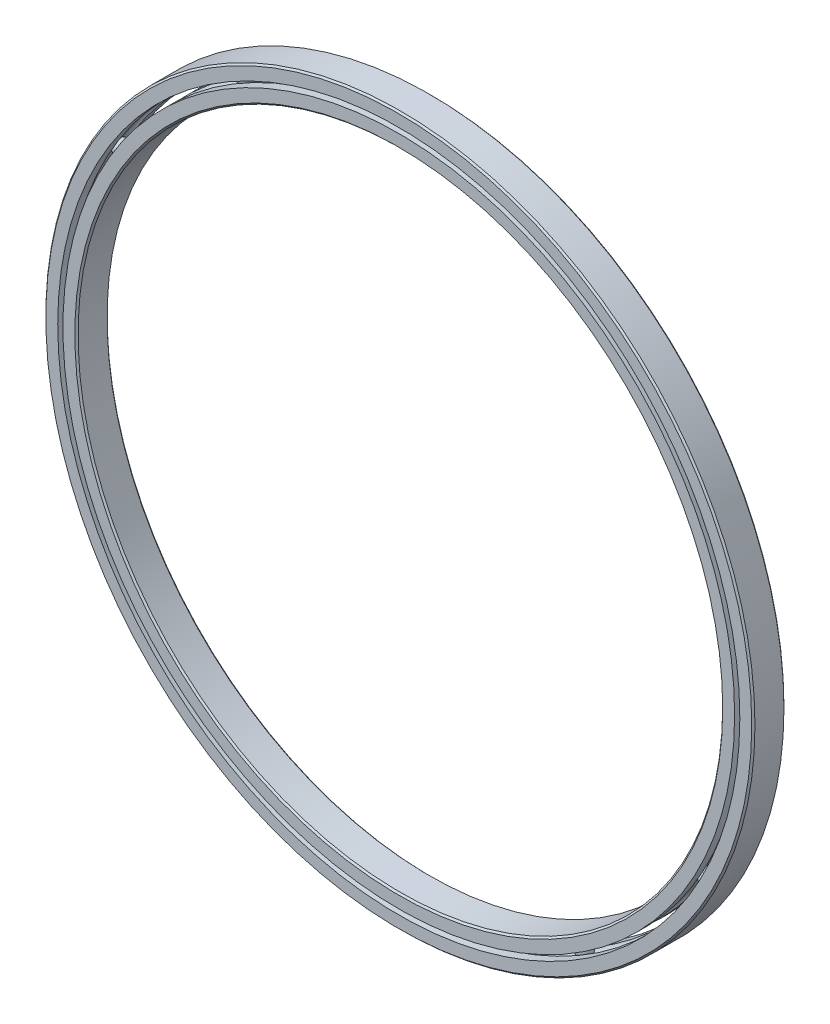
ISO-10303-21;
HEADER;
FILE_DESCRIPTION(('STEP AP214'),'2;1');
FILE_NAME('part.step','',(''),(''),'','','');
FILE_SCHEMA(('AUTOMOTIVE_DESIGN { 1 0 10303 214 1 1 1 1 }'));
ENDSEC;
DATA;
#1=APPLICATION_CONTEXT('core data for automotive mechanical design processes');
#2=APPLICATION_PROTOCOL_DEFINITION('international standard','automotive_design',2000,#1);
#3=PRODUCT_CONTEXT('',#1,'mechanical');
#4=PRODUCT('Part','Part','',(#3));
#5=PRODUCT_RELATED_PRODUCT_CATEGORY('part','',(#4));
#6=PRODUCT_DEFINITION_FORMATION('','',#4);
#7=PRODUCT_DEFINITION_CONTEXT('part definition',#1,'design');
#8=PRODUCT_DEFINITION('design','',#6,#7);
#9=PRODUCT_DEFINITION_SHAPE('','',#8);
#10=(LENGTH_UNIT() NAMED_UNIT(*) SI_UNIT(.MILLI.,.METRE.));
#11=(NAMED_UNIT(*) PLANE_ANGLE_UNIT() SI_UNIT($,.RADIAN.));
#12=(NAMED_UNIT(*) SI_UNIT($,.STERADIAN.) SOLID_ANGLE_UNIT());
#13=UNCERTAINTY_MEASURE_WITH_UNIT(LENGTH_MEASURE(1.E-05),#10,'distance_accuracy_value','');
#14=(GEOMETRIC_REPRESENTATION_CONTEXT(3) GLOBAL_UNCERTAINTY_ASSIGNED_CONTEXT((#13)) GLOBAL_UNIT_ASSIGNED_CONTEXT((#10,
#11,#12)) REPRESENTATION_CONTEXT('',''));
#15=CARTESIAN_POINT('',(0.,0.,0.));
#16=DIRECTION('',(0.,0.,1.));
#17=DIRECTION('',(1.,0.,0.));
#18=AXIS2_PLACEMENT_3D('',#15,#16,#17);
#19=CARTESIAN_POINT('',(-33.3374999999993,57.7422437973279,0.));
#20=DIRECTION('',(0.,0.,1.));
#21=DIRECTION('',(-0.499999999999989,0.866025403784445,0.));
#22=AXIS2_PLACEMENT_3D('',#19,#20,#21);
#23=SPHERICAL_SURFACE('',#22,1.50142771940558);
#24=CARTESIAN_POINT('',(-33.3374999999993,57.7422437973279,1.50142771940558));
#25=VERTEX_POINT('',#24);
#26=VERTEX_LOOP('',#25);
#27=FACE_BOUND('',#26,.T.);
#28=ADVANCED_FACE('F41',(#27),#23,.T.);
#29=CLOSED_SHELL('',(#28));
#30=MANIFOLD_SOLID_BREP('B2',#29);
#31=CARTESIAN_POINT('',(-57.7422437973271,33.3375000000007,0.));
#32=DIRECTION('',(0.,0.,1.));
#33=DIRECTION('',(-0.866025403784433,0.50000000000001,0.));
#34=AXIS2_PLACEMENT_3D('',#31,#32,#33);
#35=SPHERICAL_SURFACE('',#34,1.50142771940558);
#36=CARTESIAN_POINT('',(-57.7422437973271,33.3375000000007,1.50142771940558));
#37=VERTEX_POINT('',#36);
#38=VERTEX_LOOP('',#37);
#39=FACE_BOUND('',#38,.T.);
#40=ADVANCED_FACE('F61',(#39),#35,.T.);
#41=CLOSED_SHELL('',(#40));
#42=MANIFOLD_SOLID_BREP('B6',#41);
#43=CARTESIAN_POINT('',(-66.675,6.98383554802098E-13,0.));
#44=DIRECTION('',(0.,0.,1.));
#45=DIRECTION('',(-1.,0.,0.));
#46=AXIS2_PLACEMENT_3D('',#43,#44,#45);
#47=SPHERICAL_SURFACE('',#46,1.50142771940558);
#48=CARTESIAN_POINT('',(-66.675,6.98383554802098E-13,1.50142771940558));
#49=VERTEX_POINT('',#48);
#50=VERTEX_LOOP('',#49);
#51=FACE_BOUND('',#50,.T.);
#52=ADVANCED_FACE('F81',(#51),#47,.T.);
#53=CLOSED_SHELL('',(#52));
#54=MANIFOLD_SOLID_BREP('B37',#53);
#55=CARTESIAN_POINT('',(-57.7422437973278,-33.3374999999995,0.));
#56=DIRECTION('',(0.,0.,1.));
#57=DIRECTION('',(-0.866025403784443,-0.499999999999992,0.));
#58=AXIS2_PLACEMENT_3D('',#55,#56,#57);
#59=SPHERICAL_SURFACE('',#58,1.50142771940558);
#60=CARTESIAN_POINT('',(-57.7422437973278,-33.3374999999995,1.50142771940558));
#61=VERTEX_POINT('',#60);
#62=VERTEX_LOOP('',#61);
#63=FACE_BOUND('',#62,.T.);
#64=ADVANCED_FACE('F101',(#63),#59,.T.);
#65=CLOSED_SHELL('',(#64));
#66=MANIFOLD_SOLID_BREP('B57',#65);
#67=CARTESIAN_POINT('',(-33.3375000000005,-57.7422437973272,0.));
#68=DIRECTION('',(0.,0.,1.));
#69=DIRECTION('',(-0.500000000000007,-0.866025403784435,0.));
#70=AXIS2_PLACEMENT_3D('',#67,#68,#69);
#71=SPHERICAL_SURFACE('',#70,1.50142771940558);
#72=CARTESIAN_POINT('',(-33.3375000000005,-57.7422437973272,1.50142771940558));
#73=VERTEX_POINT('',#72);
#74=VERTEX_LOOP('',#73);
#75=FACE_BOUND('',#74,.T.);
#76=ADVANCED_FACE('F121',(#75),#71,.T.);
#77=CLOSED_SHELL('',(#76));
#78=MANIFOLD_SOLID_BREP('B77',#77);
#79=CARTESIAN_POINT('',(-4.65589036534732E-13,-66.675,0.));
#80=DIRECTION('',(0.,0.,1.));
#81=DIRECTION('',(0.,-1.,0.));
#82=AXIS2_PLACEMENT_3D('',#79,#80,#81);
#83=SPHERICAL_SURFACE('',#82,1.50142771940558);
#84=CARTESIAN_POINT('',(-4.65589036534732E-13,-66.675,1.50142771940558));
#85=VERTEX_POINT('',#84);
#86=VERTEX_LOOP('',#85);
#87=FACE_BOUND('',#86,.T.);
#88=ADVANCED_FACE('F141',(#87),#83,.T.);
#89=CLOSED_SHELL('',(#88));
#90=MANIFOLD_SOLID_BREP('B97',#89);
#91=CARTESIAN_POINT('',(33.3374999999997,-57.7422437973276,0.));
#92=DIRECTION('',(0.,0.,1.));
#93=DIRECTION('',(0.499999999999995,-0.866025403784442,0.));
#94=AXIS2_PLACEMENT_3D('',#91,#92,#93);
#95=SPHERICAL_SURFACE('',#94,1.50142771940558);
#96=CARTESIAN_POINT('',(33.3374999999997,-57.7422437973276,1.50142771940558));
#97=VERTEX_POINT('',#96);
#98=VERTEX_LOOP('',#97);
#99=FACE_BOUND('',#98,.T.);
#100=ADVANCED_FACE('F161',(#99),#95,.T.);
#101=CLOSED_SHELL('',(#100));
#102=MANIFOLD_SOLID_BREP('B117',#101);
#103=CARTESIAN_POINT('',(57.7422437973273,-33.3375000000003,0.));
#104=DIRECTION('',(0.,0.,1.));
#105=DIRECTION('',(0.866025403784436,-0.500000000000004,0.));
#106=AXIS2_PLACEMENT_3D('',#103,#104,#105);
#107=SPHERICAL_SURFACE('',#106,1.50142771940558);
#108=CARTESIAN_POINT('',(57.7422437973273,-33.3375000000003,1.50142771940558));
#109=VERTEX_POINT('',#108);
#110=VERTEX_LOOP('',#109);
#111=FACE_BOUND('',#110,.T.);
#112=ADVANCED_FACE('F181',(#111),#107,.T.);
#113=CLOSED_SHELL('',(#112));
#114=MANIFOLD_SOLID_BREP('B137',#113);
#115=CARTESIAN_POINT('',(66.675,-2.32794518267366E-13,0.));
#116=DIRECTION('',(0.,0.,1.));
#117=DIRECTION('',(1.,0.,0.));
#118=AXIS2_PLACEMENT_3D('',#115,#116,#117);
#119=SPHERICAL_SURFACE('',#118,1.50142771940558);
#120=CARTESIAN_POINT('',(66.675,-2.32794518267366E-13,1.50142771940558));
#121=VERTEX_POINT('',#120);
#122=VERTEX_LOOP('',#121);
#123=FACE_BOUND('',#122,.T.);
#124=ADVANCED_FACE('F201',(#123),#119,.T.);
#125=CLOSED_SHELL('',(#124));
#126=MANIFOLD_SOLID_BREP('B157',#125);
#127=CARTESIAN_POINT('',(57.7422437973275,33.3374999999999,0.));
#128=DIRECTION('',(0.,0.,1.));
#129=DIRECTION('',(0.86602540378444,0.499999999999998,0.));
#130=AXIS2_PLACEMENT_3D('',#127,#128,#129);
#131=SPHERICAL_SURFACE('',#130,1.50142771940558);
#132=CARTESIAN_POINT('',(57.7422437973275,33.3374999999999,1.50142771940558));
#133=VERTEX_POINT('',#132);
#134=VERTEX_LOOP('',#133);
#135=FACE_BOUND('',#134,.T.);
#136=ADVANCED_FACE('F221',(#135),#131,.T.);
#137=CLOSED_SHELL('',(#136));
#138=MANIFOLD_SOLID_BREP('B177',#137);
#139=CARTESIAN_POINT('',(33.3375000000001,57.7422437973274,0.));
#140=DIRECTION('',(0.,0.,1.));
#141=DIRECTION('',(0.500000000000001,0.866025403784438,0.));
#142=AXIS2_PLACEMENT_3D('',#139,#140,#141);
#143=SPHERICAL_SURFACE('',#142,1.50142771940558);
#144=CARTESIAN_POINT('',(33.3375000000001,57.7422437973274,1.50142771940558));
#145=VERTEX_POINT('',#144);
#146=VERTEX_LOOP('',#145);
#147=FACE_BOUND('',#146,.T.);
#148=ADVANCED_FACE('F241',(#147),#143,.T.);
#149=CLOSED_SHELL('',(#148));
#150=MANIFOLD_SOLID_BREP('B197',#149);
#151=CARTESIAN_POINT('',(0.,66.675,0.));
#152=DIRECTION('',(0.,0.,1.));
#153=DIRECTION('',(0.,1.,0.));
#154=AXIS2_PLACEMENT_3D('',#151,#152,#153);
#155=SPHERICAL_SURFACE('',#154,1.50142771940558);
#156=CARTESIAN_POINT('',(0.,66.675,1.50142771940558));
#157=VERTEX_POINT('',#156);
#158=VERTEX_LOOP('',#157);
#159=FACE_BOUND('',#158,.T.);
#160=ADVANCED_FACE('F263',(#159),#155,.T.);
#161=CLOSED_SHELL('',(#160));
#162=MANIFOLD_SOLID_BREP('B217',#161);
#163=CARTESIAN_POINT('',(0.,66.1621153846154,3.17500000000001));
#164=DIRECTION('',(0.,0.,-1.));
#165=DIRECTION('',(-1.,0.,0.));
#166=AXIS2_PLACEMENT_3D('',#163,#164,#165);
#167=PLANE('',#166);
#168=CARTESIAN_POINT('',(0.,0.,3.17500000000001));
#169=DIRECTION('',(0.,0.,1.));
#170=DIRECTION('',(1.,0.,0.));
#171=AXIS2_PLACEMENT_3D('',#168,#169,#170);
#172=CIRCLE('',#171,63.8175);
#173=CARTESIAN_POINT('',(63.8175,0.,3.17500000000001));
#174=VERTEX_POINT('',#173);
#175=EDGE_CURVE('E310',#174,#174,#172,.T.);
#176=ORIENTED_EDGE('',*,*,#175,.F.);
#177=EDGE_LOOP('',(#176));
#178=FACE_BOUND('',#177,.T.);
#179=CARTESIAN_POINT('',(0.,0.,3.17500000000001));
#180=DIRECTION('',(0.,0.,1.));
#181=DIRECTION('',(1.,0.,0.));
#182=AXIS2_PLACEMENT_3D('',#179,#180,#181);
#183=CIRCLE('',#182,66.1621153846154);
#184=CARTESIAN_POINT('',(66.1621153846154,0.,3.17500000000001));
#185=VERTEX_POINT('',#184);
#186=EDGE_CURVE('E262',#185,#185,#183,.T.);
#187=ORIENTED_EDGE('',*,*,#186,.T.);
#188=EDGE_LOOP('',(#187));
#189=FACE_BOUND('',#188,.T.);
#190=ADVANCED_FACE('F282',(#178,#189),#167,.F.);
#191=CARTESIAN_POINT('',(0.,0.,3.175));
#192=DIRECTION('',(0.,0.,1.));
#193=DIRECTION('',(1.,0.,0.));
#194=AXIS2_PLACEMENT_3D('',#191,#192,#193);
#195=CYLINDRICAL_SURFACE('',#194,66.1621153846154);
#196=ORIENTED_EDGE('',*,*,#186,.F.);
#197=EDGE_LOOP('',(#196));
#198=FACE_BOUND('',#197,.T.);
#199=CARTESIAN_POINT('',(0.,0.,1.41111111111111));
#200=DIRECTION('',(0.,0.,1.));
#201=DIRECTION('',(1.,0.,0.));
#202=AXIS2_PLACEMENT_3D('',#199,#200,#201);
#203=CIRCLE('',#202,66.1621153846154);
#204=CARTESIAN_POINT('',(66.1621153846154,0.,1.41111111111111));
#205=VERTEX_POINT('',#204);
#206=EDGE_CURVE('E288',#205,#205,#203,.T.);
#207=ORIENTED_EDGE('',*,*,#206,.T.);
#208=EDGE_LOOP('',(#207));
#209=FACE_BOUND('',#208,.T.);
#210=ADVANCED_FACE('F317',(#198,#209),#195,.T.);
#211=CARTESIAN_POINT('',(0.,0.,0.));
#212=DIRECTION('',(0.,0.,1.));
#213=DIRECTION('',(1.,0.,0.));
#214=AXIS2_PLACEMENT_3D('',#211,#212,#213);
#215=TOROIDAL_SURFACE('',#214,66.675,1.50142771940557);
#216=ORIENTED_EDGE('',*,*,#206,.F.);
#217=EDGE_LOOP('',(#216));
#218=FACE_BOUND('',#217,.T.);
#219=CARTESIAN_POINT('',(0.,0.,-1.41111111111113));
#220=DIRECTION('',(0.,0.,1.));
#221=DIRECTION('',(1.,0.,0.));
#222=AXIS2_PLACEMENT_3D('',#219,#220,#221);
#223=CIRCLE('',#222,66.1621153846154);
#224=CARTESIAN_POINT('',(66.1621153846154,0.,-1.41111111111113));
#225=VERTEX_POINT('',#224);
#226=EDGE_CURVE('E292',#225,#225,#223,.T.);
#227=ORIENTED_EDGE('',*,*,#226,.T.);
#228=EDGE_LOOP('',(#227));
#229=FACE_BOUND('',#228,.T.);
#230=ADVANCED_FACE('F321',(#218,#229),#215,.F.);
#231=CARTESIAN_POINT('',(0.,0.,3.175));
#232=DIRECTION('',(0.,0.,1.));
#233=DIRECTION('',(1.,0.,0.));
#234=AXIS2_PLACEMENT_3D('',#231,#232,#233);
#235=CYLINDRICAL_SURFACE('',#234,66.1621153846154);
#236=ORIENTED_EDGE('',*,*,#226,.F.);
#237=EDGE_LOOP('',(#236));
#238=FACE_BOUND('',#237,.T.);
#239=CARTESIAN_POINT('',(0.,0.,-3.17500000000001));
#240=DIRECTION('',(0.,0.,1.));
#241=DIRECTION('',(1.,0.,0.));
#242=AXIS2_PLACEMENT_3D('',#239,#240,#241);
#243=CIRCLE('',#242,66.1621153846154);
#244=CARTESIAN_POINT('',(66.1621153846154,0.,-3.17500000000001));
#245=VERTEX_POINT('',#244);
#246=EDGE_CURVE('E296',#245,#245,#243,.T.);
#247=ORIENTED_EDGE('',*,*,#246,.T.);
#248=EDGE_LOOP('',(#247));
#249=FACE_BOUND('',#248,.T.);
#250=ADVANCED_FACE('F326',(#238,#249),#235,.T.);
#251=CARTESIAN_POINT('',(0.,63.8175,-3.17500000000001));
#252=DIRECTION('',(0.,0.,1.));
#253=DIRECTION('',(1.,0.,0.));
#254=AXIS2_PLACEMENT_3D('',#251,#252,#253);
#255=PLANE('',#254);
#256=ORIENTED_EDGE('',*,*,#246,.F.);
#257=EDGE_LOOP('',(#256));
#258=FACE_BOUND('',#257,.T.);
#259=CARTESIAN_POINT('',(0.,0.,-3.17500000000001));
#260=DIRECTION('',(0.,0.,1.));
#261=DIRECTION('',(1.,0.,0.));
#262=AXIS2_PLACEMENT_3D('',#259,#260,#261);
#263=CIRCLE('',#262,63.8175);
#264=CARTESIAN_POINT('',(63.8175,0.,-3.17500000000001));
#265=VERTEX_POINT('',#264);
#266=EDGE_CURVE('E301',#265,#265,#263,.T.);
#267=ORIENTED_EDGE('',*,*,#266,.T.);
#268=EDGE_LOOP('',(#267));
#269=FACE_BOUND('',#268,.T.);
#270=ADVANCED_FACE('F332',(#258,#269),#255,.F.);
#271=CARTESIAN_POINT('',(0.,0.,-2.85750000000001));
#272=DIRECTION('',(0.,0.,-1.));
#273=DIRECTION('',(-1.,0.,0.));
#274=AXIS2_PLACEMENT_3D('',#271,#272,#273);
#275=CONICAL_SURFACE('',#274,63.5,0.785398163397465);
#276=ORIENTED_EDGE('',*,*,#266,.F.);
#277=EDGE_LOOP('',(#276));
#278=FACE_BOUND('',#277,.T.);
#279=CARTESIAN_POINT('',(0.,0.,-2.85750000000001));
#280=DIRECTION('',(0.,0.,1.));
#281=DIRECTION('',(1.,0.,0.));
#282=AXIS2_PLACEMENT_3D('',#279,#280,#281);
#283=CIRCLE('',#282,63.5);
#284=CARTESIAN_POINT('',(63.5,0.,-2.85750000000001));
#285=VERTEX_POINT('',#284);
#286=EDGE_CURVE('E304',#285,#285,#283,.T.);
#287=ORIENTED_EDGE('',*,*,#286,.T.);
#288=EDGE_LOOP('',(#287));
#289=FACE_BOUND('',#288,.T.);
#290=ADVANCED_FACE('F336',(#278,#289),#275,.F.);
#291=CARTESIAN_POINT('',(0.,0.,3.175));
#292=DIRECTION('',(0.,0.,1.));
#293=DIRECTION('',(1.,0.,0.));
#294=AXIS2_PLACEMENT_3D('',#291,#292,#293);
#295=CYLINDRICAL_SURFACE('',#294,63.5);
#296=ORIENTED_EDGE('',*,*,#286,.F.);
#297=EDGE_LOOP('',(#296));
#298=FACE_BOUND('',#297,.T.);
#299=CARTESIAN_POINT('',(0.,0.,2.8575));
#300=DIRECTION('',(0.,0.,1.));
#301=DIRECTION('',(1.,0.,0.));
#302=AXIS2_PLACEMENT_3D('',#299,#300,#301);
#303=CIRCLE('',#302,63.5);
#304=CARTESIAN_POINT('',(63.5,0.,2.8575));
#305=VERTEX_POINT('',#304);
#306=EDGE_CURVE('E307',#305,#305,#303,.T.);
#307=ORIENTED_EDGE('',*,*,#306,.T.);
#308=EDGE_LOOP('',(#307));
#309=FACE_BOUND('',#308,.T.);
#310=ADVANCED_FACE('F340',(#298,#309),#295,.F.);
#311=CARTESIAN_POINT('',(0.,0.,3.17500000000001));
#312=DIRECTION('',(0.,0.,1.));
#313=DIRECTION('',(1.,0.,0.));
#314=AXIS2_PLACEMENT_3D('',#311,#312,#313);
#315=CONICAL_SURFACE('',#314,63.8175,0.785398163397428);
#316=ORIENTED_EDGE('',*,*,#306,.F.);
#317=EDGE_LOOP('',(#316));
#318=FACE_BOUND('',#317,.T.);
#319=ORIENTED_EDGE('',*,*,#175,.T.);
#320=EDGE_LOOP('',(#319));
#321=FACE_BOUND('',#320,.T.);
#322=ADVANCED_FACE('F314',(#318,#321),#315,.F.);
#323=CLOSED_SHELL('',(#190,#210,#230,#250,#270,#290,#310,#322));
#324=MANIFOLD_SOLID_BREP('B237',#323);
#325=CARTESIAN_POINT('',(0.,0.,2.85750000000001));
#326=DIRECTION('',(0.,0.,-1.));
#327=DIRECTION('',(-1.,0.,0.));
#328=AXIS2_PLACEMENT_3D('',#325,#326,#327);
#329=CONICAL_SURFACE('',#328,69.85,0.785398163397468);
#330=CARTESIAN_POINT('',(0.,0.,3.17500000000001));
#331=DIRECTION('',(0.,0.,1.));
#332=DIRECTION('',(1.,0.,0.));
#333=AXIS2_PLACEMENT_3D('',#330,#331,#332);
#334=CIRCLE('',#333,69.5325);
#335=CARTESIAN_POINT('',(69.5325,0.,3.17500000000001));
#336=VERTEX_POINT('',#335);
#337=EDGE_CURVE('E431',#336,#336,#334,.T.);
#338=ORIENTED_EDGE('',*,*,#337,.F.);
#339=EDGE_LOOP('',(#338));
#340=FACE_BOUND('',#339,.T.);
#341=CARTESIAN_POINT('',(0.,0.,2.85750000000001));
#342=DIRECTION('',(0.,0.,1.));
#343=DIRECTION('',(1.,0.,0.));
#344=AXIS2_PLACEMENT_3D('',#341,#342,#343);
#345=CIRCLE('',#344,69.85);
#346=CARTESIAN_POINT('',(69.85,0.,2.85750000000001));
#347=VERTEX_POINT('',#346);
#348=EDGE_CURVE('E281',#347,#347,#345,.T.);
#349=ORIENTED_EDGE('',*,*,#348,.T.);
#350=EDGE_LOOP('',(#349));
#351=FACE_BOUND('',#350,.T.);
#352=ADVANCED_FACE('F403',(#340,#351),#329,.T.);
#353=CARTESIAN_POINT('',(0.,0.,3.175));
#354=DIRECTION('',(0.,0.,1.));
#355=DIRECTION('',(1.,0.,0.));
#356=AXIS2_PLACEMENT_3D('',#353,#354,#355);
#357=CYLINDRICAL_SURFACE('',#356,69.85);
#358=ORIENTED_EDGE('',*,*,#348,.F.);
#359=EDGE_LOOP('',(#358));
#360=FACE_BOUND('',#359,.T.);
#361=CARTESIAN_POINT('',(0.,0.,-2.85750000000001));
#362=DIRECTION('',(0.,0.,1.));
#363=DIRECTION('',(1.,0.,0.));
#364=AXIS2_PLACEMENT_3D('',#361,#362,#363);
#365=CIRCLE('',#364,69.85);
#366=CARTESIAN_POINT('',(69.85,0.,-2.85750000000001));
#367=VERTEX_POINT('',#366);
#368=EDGE_CURVE('E409',#367,#367,#365,.T.);
#369=ORIENTED_EDGE('',*,*,#368,.T.);
#370=EDGE_LOOP('',(#369));
#371=FACE_BOUND('',#370,.T.);
#372=ADVANCED_FACE('F438',(#360,#371),#357,.T.);
#373=CARTESIAN_POINT('',(0.,0.,-3.17500000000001));
#374=DIRECTION('',(0.,0.,1.));
#375=DIRECTION('',(1.,0.,0.));
#376=AXIS2_PLACEMENT_3D('',#373,#374,#375);
#377=CONICAL_SURFACE('',#376,69.5325,0.785398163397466);
#378=ORIENTED_EDGE('',*,*,#368,.F.);
#379=EDGE_LOOP('',(#378));
#380=FACE_BOUND('',#379,.T.);
#381=CARTESIAN_POINT('',(0.,0.,-3.17500000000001));
#382=DIRECTION('',(0.,0.,1.));
#383=DIRECTION('',(1.,0.,0.));
#384=AXIS2_PLACEMENT_3D('',#381,#382,#383);
#385=CIRCLE('',#384,69.5325);
#386=CARTESIAN_POINT('',(69.5325,0.,-3.17500000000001));
#387=VERTEX_POINT('',#386);
#388=EDGE_CURVE('E413',#387,#387,#385,.T.);
#389=ORIENTED_EDGE('',*,*,#388,.T.);
#390=EDGE_LOOP('',(#389));
#391=FACE_BOUND('',#390,.T.);
#392=ADVANCED_FACE('F442',(#380,#391),#377,.T.);
#393=CARTESIAN_POINT('',(0.,69.5325,-3.17500000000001));
#394=DIRECTION('',(0.,0.,1.));
#395=DIRECTION('',(1.,0.,0.));
#396=AXIS2_PLACEMENT_3D('',#393,#394,#395);
#397=PLANE('',#396);
#398=ORIENTED_EDGE('',*,*,#388,.F.);
#399=EDGE_LOOP('',(#398));
#400=FACE_BOUND('',#399,.T.);
#401=CARTESIAN_POINT('',(0.,0.,-3.17500000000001));
#402=DIRECTION('',(0.,0.,1.));
#403=DIRECTION('',(1.,0.,0.));
#404=AXIS2_PLACEMENT_3D('',#401,#402,#403);
#405=CIRCLE('',#404,67.1878846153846);
#406=CARTESIAN_POINT('',(67.1878846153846,0.,-3.17500000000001));
#407=VERTEX_POINT('',#406);
#408=EDGE_CURVE('E417',#407,#407,#405,.T.);
#409=ORIENTED_EDGE('',*,*,#408,.T.);
#410=EDGE_LOOP('',(#409));
#411=FACE_BOUND('',#410,.T.);
#412=ADVANCED_FACE('F447',(#400,#411),#397,.F.);
#413=CARTESIAN_POINT('',(0.,0.,3.175));
#414=DIRECTION('',(0.,0.,1.));
#415=DIRECTION('',(1.,0.,0.));
#416=AXIS2_PLACEMENT_3D('',#413,#414,#415);
#417=CYLINDRICAL_SURFACE('',#416,67.1878846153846);
#418=ORIENTED_EDGE('',*,*,#408,.F.);
#419=EDGE_LOOP('',(#418));
#420=FACE_BOUND('',#419,.T.);
#421=CARTESIAN_POINT('',(0.,0.,-1.41111111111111));
#422=DIRECTION('',(0.,0.,1.));
#423=DIRECTION('',(1.,0.,0.));
#424=AXIS2_PLACEMENT_3D('',#421,#422,#423);
#425=CIRCLE('',#424,67.1878846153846);
#426=CARTESIAN_POINT('',(67.1878846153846,0.,-1.41111111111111));
#427=VERTEX_POINT('',#426);
#428=EDGE_CURVE('E422',#427,#427,#425,.T.);
#429=ORIENTED_EDGE('',*,*,#428,.T.);
#430=EDGE_LOOP('',(#429));
#431=FACE_BOUND('',#430,.T.);
#432=ADVANCED_FACE('F453',(#420,#431),#417,.F.);
#433=CARTESIAN_POINT('',(0.,0.,0.));
#434=DIRECTION('',(0.,0.,1.));
#435=DIRECTION('',(1.,0.,0.));
#436=AXIS2_PLACEMENT_3D('',#433,#434,#435);
#437=TOROIDAL_SURFACE('',#436,66.675,1.50142771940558);
#438=ORIENTED_EDGE('',*,*,#428,.F.);
#439=EDGE_LOOP('',(#438));
#440=FACE_BOUND('',#439,.T.);
#441=CARTESIAN_POINT('',(0.,0.,1.41111111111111));
#442=DIRECTION('',(0.,0.,1.));
#443=DIRECTION('',(1.,0.,0.));
#444=AXIS2_PLACEMENT_3D('',#441,#442,#443);
#445=CIRCLE('',#444,67.1878846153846);
#446=CARTESIAN_POINT('',(67.1878846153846,0.,1.41111111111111));
#447=VERTEX_POINT('',#446);
#448=EDGE_CURVE('E425',#447,#447,#445,.T.);
#449=ORIENTED_EDGE('',*,*,#448,.T.);
#450=EDGE_LOOP('',(#449));
#451=FACE_BOUND('',#450,.T.);
#452=ADVANCED_FACE('F457',(#440,#451),#437,.F.);
#453=CARTESIAN_POINT('',(0.,0.,3.175));
#454=DIRECTION('',(0.,0.,1.));
#455=DIRECTION('',(1.,0.,0.));
#456=AXIS2_PLACEMENT_3D('',#453,#454,#455);
#457=CYLINDRICAL_SURFACE('',#456,67.1878846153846);
#458=ORIENTED_EDGE('',*,*,#448,.F.);
#459=EDGE_LOOP('',(#458));
#460=FACE_BOUND('',#459,.T.);
#461=CARTESIAN_POINT('',(0.,0.,3.17500000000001));
#462=DIRECTION('',(0.,0.,1.));
#463=DIRECTION('',(1.,0.,0.));
#464=AXIS2_PLACEMENT_3D('',#461,#462,#463);
#465=CIRCLE('',#464,67.1878846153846);
#466=CARTESIAN_POINT('',(67.1878846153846,0.,3.17500000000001));
#467=VERTEX_POINT('',#466);
#468=EDGE_CURVE('E428',#467,#467,#465,.T.);
#469=ORIENTED_EDGE('',*,*,#468,.T.);
#470=EDGE_LOOP('',(#469));
#471=FACE_BOUND('',#470,.T.);
#472=ADVANCED_FACE('F461',(#460,#471),#457,.F.);
#473=CARTESIAN_POINT('',(0.,69.5325,3.17500000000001));
#474=DIRECTION('',(0.,0.,-1.));
#475=DIRECTION('',(-1.,0.,0.));
#476=AXIS2_PLACEMENT_3D('',#473,#474,#475);
#477=PLANE('',#476);
#478=ORIENTED_EDGE('',*,*,#468,.F.);
#479=EDGE_LOOP('',(#478));
#480=FACE_BOUND('',#479,.T.);
#481=ORIENTED_EDGE('',*,*,#337,.T.);
#482=EDGE_LOOP('',(#481));
#483=FACE_BOUND('',#482,.T.);
#484=ADVANCED_FACE('F435',(#480,#483),#477,.F.);
#485=CLOSED_SHELL('',(#352,#372,#392,#412,#432,#452,#472,#484));
#486=MANIFOLD_SOLID_BREP('B257',#485);
#487=ADVANCED_BREP_SHAPE_REPRESENTATION('',(#18,#30,#42,#54,#66,#78,#90,#102,#114,#126,#138,
#150,#162,#324,#486),#14);
#488=SHAPE_DEFINITION_REPRESENTATION(#9,#487);
ENDSEC;
END-ISO-10303-21;
